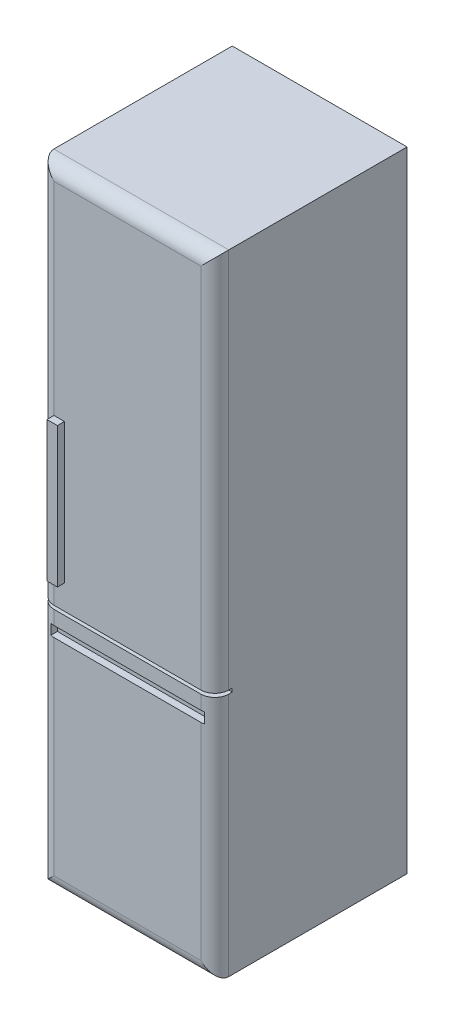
ISO-10303-21;
HEADER;
FILE_DESCRIPTION(('STEP AP214'),'2;1');
FILE_NAME('part.step','',(''),(''),'','','');
FILE_SCHEMA(('AUTOMOTIVE_DESIGN { 1 0 10303 214 1 1 1 1 }'));
ENDSEC;
DATA;
#1=APPLICATION_CONTEXT('core data for automotive mechanical design processes');
#2=APPLICATION_PROTOCOL_DEFINITION('international standard','automotive_design',2000,#1);
#3=PRODUCT_CONTEXT('',#1,'mechanical');
#4=PRODUCT('Part','Part','',(#3));
#5=PRODUCT_RELATED_PRODUCT_CATEGORY('part','',(#4));
#6=PRODUCT_DEFINITION_FORMATION('','',#4);
#7=PRODUCT_DEFINITION_CONTEXT('part definition',#1,'design');
#8=PRODUCT_DEFINITION('design','',#6,#7);
#9=PRODUCT_DEFINITION_SHAPE('','',#8);
#10=(LENGTH_UNIT() NAMED_UNIT(*) SI_UNIT(.MILLI.,.METRE.));
#11=(NAMED_UNIT(*) PLANE_ANGLE_UNIT() SI_UNIT($,.RADIAN.));
#12=(NAMED_UNIT(*) SI_UNIT($,.STERADIAN.) SOLID_ANGLE_UNIT());
#13=UNCERTAINTY_MEASURE_WITH_UNIT(LENGTH_MEASURE(1.E-05),#10,'distance_accuracy_value','');
#14=(GEOMETRIC_REPRESENTATION_CONTEXT(3) GLOBAL_UNCERTAINTY_ASSIGNED_CONTEXT((#13)) GLOBAL_UNIT_ASSIGNED_CONTEXT((#10,
#11,#12)) REPRESENTATION_CONTEXT('',''));
#15=CARTESIAN_POINT('',(0.,0.,0.));
#16=DIRECTION('',(0.,0.,1.));
#17=DIRECTION('',(1.,0.,0.));
#18=AXIS2_PLACEMENT_3D('',#15,#16,#17);
#19=CARTESIAN_POINT('',(0.,1800.,550.));
#20=DIRECTION('',(0.,0.,-1.));
#21=DIRECTION('',(-1.,0.,0.));
#22=AXIS2_PLACEMENT_3D('',#19,#20,#21);
#23=PLANE('',#22);
#24=DIRECTION('',(-1.,0.,0.));
#25=VECTOR('',#24,1.);
#26=CARTESIAN_POINT('',(30.0000000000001,660.,550.));
#27=LINE('',#26,#25);
#28=CARTESIAN_POINT('',(460.,660.,550.));
#29=VERTEX_POINT('',#28);
#30=CARTESIAN_POINT('',(40.0000000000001,660.,550.));
#31=VERTEX_POINT('',#30);
#32=EDGE_CURVE('E207',#29,#31,#27,.T.);
#33=ORIENTED_EDGE('',*,*,#32,.F.);
#34=DIRECTION('',(0.,-1.,0.));
#35=VECTOR('',#34,1.);
#36=CARTESIAN_POINT('',(460.,1800.,550.));
#37=LINE('',#36,#35);
#38=CARTESIAN_POINT('',(460.,700.,550.));
#39=VERTEX_POINT('',#38);
#40=EDGE_CURVE('E313',#29,#39,#37,.F.);
#41=ORIENTED_EDGE('',*,*,#40,.T.);
#42=DIRECTION('',(1.,0.,0.));
#43=VECTOR('',#42,1.);
#44=CARTESIAN_POINT('',(0.,700.,550.));
#45=LINE('',#44,#43);
#46=CARTESIAN_POINT('',(40.0000000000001,700.,550.));
#47=VERTEX_POINT('',#46);
#48=EDGE_CURVE('E256',#47,#39,#45,.T.);
#49=ORIENTED_EDGE('',*,*,#48,.F.);
#50=DIRECTION('',(0.,-1.,0.));
#51=VECTOR('',#50,1.);
#52=CARTESIAN_POINT('',(40.0000000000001,1800.,550.));
#53=LINE('',#52,#51);
#54=EDGE_CURVE('E311',#47,#31,#53,.T.);
#55=ORIENTED_EDGE('',*,*,#54,.T.);
#56=EDGE_LOOP('',(#33,#41,#49,#55));
#57=FACE_BOUND('',#56,.T.);
#58=ADVANCED_FACE('F33',(#57),#23,.F.);
#59=DIRECTION('',(-1.,0.,0.));
#60=VECTOR('',#59,1.);
#61=CARTESIAN_POINT('',(0.,710.,550.));
#62=LINE('',#61,#60);
#63=CARTESIAN_POINT('',(460.,710.,550.));
#64=VERTEX_POINT('',#63);
#65=CARTESIAN_POINT('',(40.0000000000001,710.,550.));
#66=VERTEX_POINT('',#65);
#67=EDGE_CURVE('E261',#64,#66,#62,.T.);
#68=ORIENTED_EDGE('',*,*,#67,.F.);
#69=DIRECTION('',(0.,-1.,0.));
#70=VECTOR('',#69,1.);
#71=CARTESIAN_POINT('',(460.,1800.,550.));
#72=LINE('',#71,#70);
#73=CARTESIAN_POINT('',(460.,1760.,550.));
#74=VERTEX_POINT('',#73);
#75=EDGE_CURVE('E42',#64,#74,#72,.F.);
#76=ORIENTED_EDGE('',*,*,#75,.T.);
#77=DIRECTION('',(1.,0.,0.));
#78=VECTOR('',#77,1.);
#79=CARTESIAN_POINT('',(0.,1760.,550.));
#80=LINE('',#79,#78);
#81=CARTESIAN_POINT('',(40.0000000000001,1760.,550.));
#82=VERTEX_POINT('',#81);
#83=EDGE_CURVE('E53',#74,#82,#80,.F.);
#84=ORIENTED_EDGE('',*,*,#83,.T.);
#85=DIRECTION('',(0.,-1.,0.));
#86=VECTOR('',#85,1.);
#87=CARTESIAN_POINT('',(40.0000000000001,1800.,550.));
#88=LINE('',#87,#86);
#89=CARTESIAN_POINT('',(40.0000000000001,1180.,550.));
#90=VERTEX_POINT('',#89);
#91=EDGE_CURVE('E347',#82,#90,#88,.T.);
#92=ORIENTED_EDGE('',*,*,#91,.T.);
#93=DIRECTION('',(-1.,0.,0.));
#94=VECTOR('',#93,1.);
#95=CARTESIAN_POINT('',(40.0000000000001,1180.,550.));
#96=LINE('',#95,#94);
#97=CARTESIAN_POINT('',(70.0000000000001,1180.,550.));
#98=VERTEX_POINT('',#97);
#99=EDGE_CURVE('E228',#98,#90,#96,.T.);
#100=ORIENTED_EDGE('',*,*,#99,.F.);
#101=DIRECTION('',(0.,1.,0.));
#102=VECTOR('',#101,1.);
#103=CARTESIAN_POINT('',(70.0000000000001,1180.,550.));
#104=LINE('',#103,#102);
#105=CARTESIAN_POINT('',(70.0000000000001,780.,550.));
#106=VERTEX_POINT('',#105);
#107=EDGE_CURVE('E240',#106,#98,#104,.T.);
#108=ORIENTED_EDGE('',*,*,#107,.F.);
#109=DIRECTION('',(1.,0.,0.));
#110=VECTOR('',#109,1.);
#111=CARTESIAN_POINT('',(40.0000000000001,780.,550.));
#112=LINE('',#111,#110);
#113=CARTESIAN_POINT('',(40.0000000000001,780.,550.));
#114=VERTEX_POINT('',#113);
#115=EDGE_CURVE('E237',#114,#106,#112,.T.);
#116=ORIENTED_EDGE('',*,*,#115,.F.);
#117=DIRECTION('',(0.,-1.,0.));
#118=VECTOR('',#117,1.);
#119=CARTESIAN_POINT('',(40.0000000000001,1800.,550.));
#120=LINE('',#119,#118);
#121=EDGE_CURVE('E345',#114,#66,#120,.T.);
#122=ORIENTED_EDGE('',*,*,#121,.T.);
#123=EDGE_LOOP('',(#68,#76,#84,#92,#100,#108,#116,#122));
#124=FACE_BOUND('',#123,.T.);
#125=ADVANCED_FACE('F369',(#124),#23,.F.);
#126=CARTESIAN_POINT('',(0.,1800.,0.));
#127=DIRECTION('',(1.,0.,0.));
#128=DIRECTION('',(0.,0.,-1.));
#129=AXIS2_PLACEMENT_3D('',#126,#127,#128);
#130=PLANE('',#129);
#131=DIRECTION('',(0.,0.,1.));
#132=VECTOR('',#131,1.);
#133=CARTESIAN_POINT('',(0.,0.,0.));
#134=LINE('',#133,#132);
#135=CARTESIAN_POINT('',(0.,0.,0.));
#136=VERTEX_POINT('',#135);
#137=CARTESIAN_POINT('',(0.,0.,510.));
#138=VERTEX_POINT('',#137);
#139=EDGE_CURVE('E276',#136,#138,#134,.T.);
#140=ORIENTED_EDGE('',*,*,#139,.T.);
#141=DIRECTION('',(0.,-1.,0.));
#142=VECTOR('',#141,1.);
#143=CARTESIAN_POINT('',(0.,1800.,510.));
#144=LINE('',#143,#142);
#145=CARTESIAN_POINT('',(0.,700.,510.));
#146=VERTEX_POINT('',#145);
#147=EDGE_CURVE('E339',#138,#146,#144,.F.);
#148=ORIENTED_EDGE('',*,*,#147,.T.);
#149=DIRECTION('',(0.,0.,1.));
#150=VECTOR('',#149,1.);
#151=CARTESIAN_POINT('',(0.,700.,500.));
#152=LINE('',#151,#150);
#153=CARTESIAN_POINT('',(0.,700.,500.));
#154=VERTEX_POINT('',#153);
#155=EDGE_CURVE('E268',#154,#146,#152,.T.);
#156=ORIENTED_EDGE('',*,*,#155,.F.);
#157=DIRECTION('',(0.,-1.,0.));
#158=VECTOR('',#157,1.);
#159=CARTESIAN_POINT('',(0.,710.,500.));
#160=LINE('',#159,#158);
#161=CARTESIAN_POINT('',(0.,710.,500.));
#162=VERTEX_POINT('',#161);
#163=EDGE_CURVE('E257',#162,#154,#160,.T.);
#164=ORIENTED_EDGE('',*,*,#163,.F.);
#165=DIRECTION('',(0.,0.,1.));
#166=VECTOR('',#165,1.);
#167=CARTESIAN_POINT('',(0.,710.,500.));
#168=LINE('',#167,#166);
#169=CARTESIAN_POINT('',(0.,710.,510.));
#170=VERTEX_POINT('',#169);
#171=EDGE_CURVE('E273',#162,#170,#168,.T.);
#172=ORIENTED_EDGE('',*,*,#171,.T.);
#173=DIRECTION('',(0.,-1.,0.));
#174=VECTOR('',#173,1.);
#175=CARTESIAN_POINT('',(0.,1800.,510.));
#176=LINE('',#175,#174);
#177=CARTESIAN_POINT('',(0.,1800.,510.));
#178=VERTEX_POINT('',#177);
#179=EDGE_CURVE('E337',#170,#178,#176,.F.);
#180=ORIENTED_EDGE('',*,*,#179,.T.);
#181=DIRECTION('',(0.,0.,1.));
#182=VECTOR('',#181,1.);
#183=CARTESIAN_POINT('',(0.,1800.,0.));
#184=LINE('',#183,#182);
#185=CARTESIAN_POINT('',(0.,1800.,0.));
#186=VERTEX_POINT('',#185);
#187=EDGE_CURVE('E285',#186,#178,#184,.T.);
#188=ORIENTED_EDGE('',*,*,#187,.F.);
#189=DIRECTION('',(0.,-1.,0.));
#190=VECTOR('',#189,1.);
#191=CARTESIAN_POINT('',(0.,1800.,0.));
#192=LINE('',#191,#190);
#193=EDGE_CURVE('E293',#186,#136,#192,.T.);
#194=ORIENTED_EDGE('',*,*,#193,.T.);
#195=EDGE_LOOP('',(#140,#148,#156,#164,#172,#180,#188,#194));
#196=FACE_BOUND('',#195,.T.);
#197=ADVANCED_FACE('F403',(#196),#130,.F.);
#198=DIRECTION('',(1.,0.,0.));
#199=VECTOR('',#198,1.);
#200=CARTESIAN_POINT('',(0.,40.,550.));
#201=LINE('',#200,#199);
#202=CARTESIAN_POINT('',(40.0000000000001,40.,550.));
#203=VERTEX_POINT('',#202);
#204=CARTESIAN_POINT('',(460.,40.,550.));
#205=VERTEX_POINT('',#204);
#206=EDGE_CURVE('E306',#203,#205,#201,.T.);
#207=ORIENTED_EDGE('',*,*,#206,.T.);
#208=DIRECTION('',(0.,-1.,0.));
#209=VECTOR('',#208,1.);
#210=CARTESIAN_POINT('',(460.,1800.,550.));
#211=LINE('',#210,#209);
#212=CARTESIAN_POINT('',(460.,630.,550.));
#213=VERTEX_POINT('',#212);
#214=EDGE_CURVE('E309',#205,#213,#211,.F.);
#215=ORIENTED_EDGE('',*,*,#214,.T.);
#216=DIRECTION('',(1.,0.,0.));
#217=VECTOR('',#216,1.);
#218=CARTESIAN_POINT('',(30.0000000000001,630.,550.));
#219=LINE('',#218,#217);
#220=CARTESIAN_POINT('',(40.0000000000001,630.,550.));
#221=VERTEX_POINT('',#220);
#222=EDGE_CURVE('E210',#221,#213,#219,.T.);
#223=ORIENTED_EDGE('',*,*,#222,.F.);
#224=DIRECTION('',(0.,-1.,0.));
#225=VECTOR('',#224,1.);
#226=CARTESIAN_POINT('',(40.0000000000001,1800.,550.));
#227=LINE('',#226,#225);
#228=EDGE_CURVE('E304',#221,#203,#227,.T.);
#229=ORIENTED_EDGE('',*,*,#228,.T.);
#230=EDGE_LOOP('',(#207,#215,#223,#229));
#231=FACE_BOUND('',#230,.T.);
#232=ADVANCED_FACE('F399',(#231),#23,.F.);
#233=CARTESIAN_POINT('',(500.,1800.,0.));
#234=DIRECTION('',(-1.,0.,0.));
#235=DIRECTION('',(0.,0.,1.));
#236=AXIS2_PLACEMENT_3D('',#233,#234,#235);
#237=PLANE('',#236);
#238=DIRECTION('',(0.,0.,1.));
#239=VECTOR('',#238,1.);
#240=CARTESIAN_POINT('',(500.,700.,500.));
#241=LINE('',#240,#239);
#242=CARTESIAN_POINT('',(500.,700.,500.));
#243=VERTEX_POINT('',#242);
#244=CARTESIAN_POINT('',(500.,700.,510.));
#245=VERTEX_POINT('',#244);
#246=EDGE_CURVE('E280',#243,#245,#241,.T.);
#247=ORIENTED_EDGE('',*,*,#246,.T.);
#248=DIRECTION('',(0.,-1.,0.));
#249=VECTOR('',#248,1.);
#250=CARTESIAN_POINT('',(500.,1800.,510.));
#251=LINE('',#250,#249);
#252=CARTESIAN_POINT('',(500.,0.,510.));
#253=VERTEX_POINT('',#252);
#254=EDGE_CURVE('E320',#245,#253,#251,.T.);
#255=ORIENTED_EDGE('',*,*,#254,.T.);
#256=DIRECTION('',(0.,0.,-1.));
#257=VECTOR('',#256,1.);
#258=CARTESIAN_POINT('',(500.,0.,0.));
#259=LINE('',#258,#257);
#260=CARTESIAN_POINT('',(500.,0.,0.));
#261=VERTEX_POINT('',#260);
#262=EDGE_CURVE('E296',#253,#261,#259,.T.);
#263=ORIENTED_EDGE('',*,*,#262,.T.);
#264=DIRECTION('',(0.,-1.,0.));
#265=VECTOR('',#264,1.);
#266=CARTESIAN_POINT('',(500.,1800.,0.));
#267=LINE('',#266,#265);
#268=CARTESIAN_POINT('',(500.,1800.,0.));
#269=VERTEX_POINT('',#268);
#270=EDGE_CURVE('E301',#269,#261,#267,.T.);
#271=ORIENTED_EDGE('',*,*,#270,.F.);
#272=DIRECTION('',(0.,0.,-1.));
#273=VECTOR('',#272,1.);
#274=CARTESIAN_POINT('',(500.,1800.,0.));
#275=LINE('',#274,#273);
#276=CARTESIAN_POINT('',(500.,1800.,510.));
#277=VERTEX_POINT('',#276);
#278=EDGE_CURVE('E288',#277,#269,#275,.T.);
#279=ORIENTED_EDGE('',*,*,#278,.F.);
#280=DIRECTION('',(0.,-1.,0.));
#281=VECTOR('',#280,1.);
#282=CARTESIAN_POINT('',(500.,1800.,510.));
#283=LINE('',#282,#281);
#284=CARTESIAN_POINT('',(500.,710.,510.));
#285=VERTEX_POINT('',#284);
#286=EDGE_CURVE('E317',#277,#285,#283,.T.);
#287=ORIENTED_EDGE('',*,*,#286,.T.);
#288=DIRECTION('',(0.,0.,1.));
#289=VECTOR('',#288,1.);
#290=CARTESIAN_POINT('',(500.,710.,500.));
#291=LINE('',#290,#289);
#292=CARTESIAN_POINT('',(500.,710.,500.));
#293=VERTEX_POINT('',#292);
#294=EDGE_CURVE('E277',#293,#285,#291,.T.);
#295=ORIENTED_EDGE('',*,*,#294,.F.);
#296=DIRECTION('',(0.,1.,0.));
#297=VECTOR('',#296,1.);
#298=CARTESIAN_POINT('',(500.,710.,500.));
#299=LINE('',#298,#297);
#300=EDGE_CURVE('E263',#243,#293,#299,.T.);
#301=ORIENTED_EDGE('',*,*,#300,.F.);
#302=EDGE_LOOP('',(#247,#255,#263,#271,#279,#287,#295,#301));
#303=FACE_BOUND('',#302,.T.);
#304=ADVANCED_FACE('F408',(#303),#237,.F.);
#305=CARTESIAN_POINT('',(0.,1800.,0.));
#306=DIRECTION('',(0.,0.,1.));
#307=DIRECTION('',(1.,0.,0.));
#308=AXIS2_PLACEMENT_3D('',#305,#306,#307);
#309=PLANE('',#308);
#310=DIRECTION('',(-1.,0.,0.));
#311=VECTOR('',#310,1.);
#312=CARTESIAN_POINT('',(0.,0.,0.));
#313=LINE('',#312,#311);
#314=EDGE_CURVE('E289',#261,#136,#313,.T.);
#315=ORIENTED_EDGE('',*,*,#314,.T.);
#316=ORIENTED_EDGE('',*,*,#193,.F.);
#317=DIRECTION('',(-1.,0.,0.));
#318=VECTOR('',#317,1.);
#319=CARTESIAN_POINT('',(0.,1800.,0.));
#320=LINE('',#319,#318);
#321=EDGE_CURVE('E291',#269,#186,#320,.T.);
#322=ORIENTED_EDGE('',*,*,#321,.F.);
#323=ORIENTED_EDGE('',*,*,#270,.T.);
#324=EDGE_LOOP('',(#315,#316,#322,#323));
#325=FACE_BOUND('',#324,.T.);
#326=ADVANCED_FACE('F414',(#325),#309,.F.);
#327=CARTESIAN_POINT('',(0.,1800.,0.));
#328=DIRECTION('',(0.,1.,0.));
#329=DIRECTION('',(0.,0.,1.));
#330=AXIS2_PLACEMENT_3D('',#327,#328,#329);
#331=PLANE('',#330);
#332=ORIENTED_EDGE('',*,*,#187,.T.);
#333=DIRECTION('',(1.,0.,0.));
#334=VECTOR('',#333,1.);
#335=CARTESIAN_POINT('',(500.,1800.,510.));
#336=LINE('',#335,#334);
#337=EDGE_CURVE('E11',#178,#277,#336,.T.);
#338=ORIENTED_EDGE('',*,*,#337,.T.);
#339=ORIENTED_EDGE('',*,*,#278,.T.);
#340=ORIENTED_EDGE('',*,*,#321,.T.);
#341=EDGE_LOOP('',(#332,#338,#339,#340));
#342=FACE_BOUND('',#341,.T.);
#343=ADVANCED_FACE('F461',(#342),#331,.T.);
#344=CARTESIAN_POINT('',(0.,0.,0.));
#345=DIRECTION('',(0.,1.,0.));
#346=DIRECTION('',(0.,0.,1.));
#347=AXIS2_PLACEMENT_3D('',#344,#345,#346);
#348=PLANE('',#347);
#349=ORIENTED_EDGE('',*,*,#262,.F.);
#350=DIRECTION('',(1.,0.,0.));
#351=VECTOR('',#350,1.);
#352=CARTESIAN_POINT('',(0.,0.,510.));
#353=LINE('',#352,#351);
#354=EDGE_CURVE('E315',#253,#138,#353,.F.);
#355=ORIENTED_EDGE('',*,*,#354,.T.);
#356=ORIENTED_EDGE('',*,*,#139,.F.);
#357=ORIENTED_EDGE('',*,*,#314,.F.);
#358=EDGE_LOOP('',(#349,#355,#356,#357));
#359=FACE_BOUND('',#358,.T.);
#360=ADVANCED_FACE('F467',(#359),#348,.F.);
#361=CARTESIAN_POINT('',(0.,710.,500.));
#362=DIRECTION('',(0.,1.,0.));
#363=DIRECTION('',(0.,0.,1.));
#364=AXIS2_PLACEMENT_3D('',#361,#362,#363);
#365=PLANE('',#364);
#366=ORIENTED_EDGE('',*,*,#294,.T.);
#367=CARTESIAN_POINT('',(460.,710.,510.));
#368=DIRECTION('',(0.,1.,0.));
#369=DIRECTION('',(0.,0.,1.));
#370=AXIS2_PLACEMENT_3D('',#367,#368,#369);
#371=CIRCLE('',#370,40.);
#372=EDGE_CURVE('E343',#285,#64,#371,.F.);
#373=ORIENTED_EDGE('',*,*,#372,.T.);
#374=ORIENTED_EDGE('',*,*,#67,.T.);
#375=CARTESIAN_POINT('',(40.0000000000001,710.,510.));
#376=DIRECTION('',(0.,1.,0.));
#377=DIRECTION('',(0.,0.,1.));
#378=AXIS2_PLACEMENT_3D('',#375,#376,#377);
#379=CIRCLE('',#378,40.);
#380=EDGE_CURVE('E341',#66,#170,#379,.F.);
#381=ORIENTED_EDGE('',*,*,#380,.T.);
#382=ORIENTED_EDGE('',*,*,#171,.F.);
#383=DIRECTION('',(-1.,0.,0.));
#384=VECTOR('',#383,1.);
#385=CARTESIAN_POINT('',(0.,710.,500.));
#386=LINE('',#385,#384);
#387=EDGE_CURVE('E265',#293,#162,#386,.T.);
#388=ORIENTED_EDGE('',*,*,#387,.F.);
#389=EDGE_LOOP('',(#366,#373,#374,#381,#382,#388));
#390=FACE_BOUND('',#389,.T.);
#391=ADVANCED_FACE('F454',(#390),#365,.F.);
#392=CARTESIAN_POINT('',(0.,700.,500.));
#393=DIRECTION('',(0.,-1.,0.));
#394=DIRECTION('',(0.,0.,-1.));
#395=AXIS2_PLACEMENT_3D('',#392,#393,#394);
#396=PLANE('',#395);
#397=ORIENTED_EDGE('',*,*,#48,.T.);
#398=CARTESIAN_POINT('',(460.,700.,510.));
#399=DIRECTION('',(0.,-1.,0.));
#400=DIRECTION('',(0.,0.,-1.));
#401=AXIS2_PLACEMENT_3D('',#398,#399,#400);
#402=CIRCLE('',#401,40.);
#403=EDGE_CURVE('E334',#39,#245,#402,.F.);
#404=ORIENTED_EDGE('',*,*,#403,.T.);
#405=ORIENTED_EDGE('',*,*,#246,.F.);
#406=DIRECTION('',(1.,0.,0.));
#407=VECTOR('',#406,1.);
#408=CARTESIAN_POINT('',(0.,700.,500.));
#409=LINE('',#408,#407);
#410=EDGE_CURVE('E260',#154,#243,#409,.T.);
#411=ORIENTED_EDGE('',*,*,#410,.F.);
#412=ORIENTED_EDGE('',*,*,#155,.T.);
#413=CARTESIAN_POINT('',(40.0000000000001,700.,510.));
#414=DIRECTION('',(0.,-1.,0.));
#415=DIRECTION('',(0.,0.,-1.));
#416=AXIS2_PLACEMENT_3D('',#413,#414,#415);
#417=CIRCLE('',#416,40.);
#418=EDGE_CURVE('E332',#146,#47,#417,.F.);
#419=ORIENTED_EDGE('',*,*,#418,.T.);
#420=EDGE_LOOP('',(#397,#404,#405,#411,#412,#419));
#421=FACE_BOUND('',#420,.T.);
#422=ADVANCED_FACE('F446',(#421),#396,.F.);
#423=CARTESIAN_POINT('',(0.,0.,500.));
#424=DIRECTION('',(0.,0.,1.));
#425=DIRECTION('',(1.,0.,0.));
#426=AXIS2_PLACEMENT_3D('',#423,#424,#425);
#427=PLANE('',#426);
#428=ORIENTED_EDGE('',*,*,#163,.T.);
#429=ORIENTED_EDGE('',*,*,#410,.T.);
#430=ORIENTED_EDGE('',*,*,#300,.T.);
#431=ORIENTED_EDGE('',*,*,#387,.T.);
#432=EDGE_LOOP('',(#428,#429,#430,#431));
#433=FACE_BOUND('',#432,.T.);
#434=ADVANCED_FACE('F394',(#433),#427,.T.);
#435=CARTESIAN_POINT('',(40.0000000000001,1180.,570.));
#436=DIRECTION('',(1.,0.,0.));
#437=DIRECTION('',(0.,1.,0.));
#438=AXIS2_PLACEMENT_3D('',#435,#436,#437);
#439=PLANE('',#438);
#440=DIRECTION('',(0.,-1.,0.));
#441=VECTOR('',#440,1.);
#442=CARTESIAN_POINT('',(40.0000000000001,1180.,550.));
#443=LINE('',#442,#441);
#444=EDGE_CURVE('E219',#90,#114,#443,.T.);
#445=ORIENTED_EDGE('',*,*,#444,.T.);
#446=DIRECTION('',(0.,0.,-1.));
#447=VECTOR('',#446,1.);
#448=CARTESIAN_POINT('',(40.0000000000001,780.,570.));
#449=LINE('',#448,#447);
#450=CARTESIAN_POINT('',(40.0000000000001,780.,570.));
#451=VERTEX_POINT('',#450);
#452=EDGE_CURVE('E253',#451,#114,#449,.T.);
#453=ORIENTED_EDGE('',*,*,#452,.F.);
#454=DIRECTION('',(0.,-1.,0.));
#455=VECTOR('',#454,1.);
#456=CARTESIAN_POINT('',(40.0000000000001,1180.,570.));
#457=LINE('',#456,#455);
#458=CARTESIAN_POINT('',(40.0000000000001,1180.,570.));
#459=VERTEX_POINT('',#458);
#460=EDGE_CURVE('E224',#459,#451,#457,.T.);
#461=ORIENTED_EDGE('',*,*,#460,.F.);
#462=DIRECTION('',(0.,0.,-1.));
#463=VECTOR('',#462,1.);
#464=CARTESIAN_POINT('',(40.0000000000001,1180.,570.));
#465=LINE('',#464,#463);
#466=EDGE_CURVE('E234',#459,#90,#465,.T.);
#467=ORIENTED_EDGE('',*,*,#466,.T.);
#468=EDGE_LOOP('',(#445,#453,#461,#467));
#469=FACE_BOUND('',#468,.T.);
#470=ADVANCED_FACE('F377',(#469),#439,.F.);
#471=CARTESIAN_POINT('',(40.0000000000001,780.,570.));
#472=DIRECTION('',(0.,1.,0.));
#473=DIRECTION('',(0.,0.,1.));
#474=AXIS2_PLACEMENT_3D('',#471,#472,#473);
#475=PLANE('',#474);
#476=ORIENTED_EDGE('',*,*,#115,.T.);
#477=DIRECTION('',(0.,0.,-1.));
#478=VECTOR('',#477,1.);
#479=CARTESIAN_POINT('',(70.0000000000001,780.,570.));
#480=LINE('',#479,#478);
#481=CARTESIAN_POINT('',(70.0000000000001,780.,570.));
#482=VERTEX_POINT('',#481);
#483=EDGE_CURVE('E250',#482,#106,#480,.T.);
#484=ORIENTED_EDGE('',*,*,#483,.F.);
#485=DIRECTION('',(1.,0.,0.));
#486=VECTOR('',#485,1.);
#487=CARTESIAN_POINT('',(40.0000000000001,780.,570.));
#488=LINE('',#487,#486);
#489=EDGE_CURVE('E227',#451,#482,#488,.T.);
#490=ORIENTED_EDGE('',*,*,#489,.F.);
#491=ORIENTED_EDGE('',*,*,#452,.T.);
#492=EDGE_LOOP('',(#476,#484,#490,#491));
#493=FACE_BOUND('',#492,.T.);
#494=ADVANCED_FACE('F386',(#493),#475,.F.);
#495=CARTESIAN_POINT('',(70.0000000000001,1180.,570.));
#496=DIRECTION('',(-1.,0.,0.));
#497=DIRECTION('',(0.,-1.,0.));
#498=AXIS2_PLACEMENT_3D('',#495,#496,#497);
#499=PLANE('',#498);
#500=ORIENTED_EDGE('',*,*,#107,.T.);
#501=DIRECTION('',(0.,0.,-1.));
#502=VECTOR('',#501,1.);
#503=CARTESIAN_POINT('',(70.0000000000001,1180.,570.));
#504=LINE('',#503,#502);
#505=CARTESIAN_POINT('',(70.0000000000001,1180.,570.));
#506=VERTEX_POINT('',#505);
#507=EDGE_CURVE('E247',#506,#98,#504,.T.);
#508=ORIENTED_EDGE('',*,*,#507,.F.);
#509=DIRECTION('',(0.,1.,0.));
#510=VECTOR('',#509,1.);
#511=CARTESIAN_POINT('',(70.0000000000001,1180.,570.));
#512=LINE('',#511,#510);
#513=EDGE_CURVE('E230',#482,#506,#512,.T.);
#514=ORIENTED_EDGE('',*,*,#513,.F.);
#515=ORIENTED_EDGE('',*,*,#483,.T.);
#516=EDGE_LOOP('',(#500,#508,#514,#515));
#517=FACE_BOUND('',#516,.T.);
#518=ADVANCED_FACE('F384',(#517),#499,.F.);
#519=CARTESIAN_POINT('',(40.0000000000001,1180.,570.));
#520=DIRECTION('',(0.,-1.,0.));
#521=DIRECTION('',(0.,0.,-1.));
#522=AXIS2_PLACEMENT_3D('',#519,#520,#521);
#523=PLANE('',#522);
#524=ORIENTED_EDGE('',*,*,#99,.T.);
#525=ORIENTED_EDGE('',*,*,#466,.F.);
#526=DIRECTION('',(-1.,0.,0.));
#527=VECTOR('',#526,1.);
#528=CARTESIAN_POINT('',(40.0000000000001,1180.,570.));
#529=LINE('',#528,#527);
#530=EDGE_CURVE('E232',#506,#459,#529,.T.);
#531=ORIENTED_EDGE('',*,*,#530,.F.);
#532=ORIENTED_EDGE('',*,*,#507,.T.);
#533=EDGE_LOOP('',(#524,#525,#531,#532));
#534=FACE_BOUND('',#533,.T.);
#535=ADVANCED_FACE('F372',(#534),#523,.F.);
#536=CARTESIAN_POINT('',(0.,0.,570.));
#537=DIRECTION('',(0.,0.,1.));
#538=DIRECTION('',(1.,0.,0.));
#539=AXIS2_PLACEMENT_3D('',#536,#537,#538);
#540=PLANE('',#539);
#541=ORIENTED_EDGE('',*,*,#460,.T.);
#542=ORIENTED_EDGE('',*,*,#489,.T.);
#543=ORIENTED_EDGE('',*,*,#513,.T.);
#544=ORIENTED_EDGE('',*,*,#530,.T.);
#545=EDGE_LOOP('',(#541,#542,#543,#544));
#546=FACE_BOUND('',#545,.T.);
#547=ADVANCED_FACE('F380',(#546),#540,.T.);
#548=CARTESIAN_POINT('',(30.0000000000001,660.,530.));
#549=DIRECTION('',(-1.,0.,0.));
#550=DIRECTION('',(0.,-1.,0.));
#551=AXIS2_PLACEMENT_3D('',#548,#549,#550);
#552=PLANE('',#551);
#553=DIRECTION('',(0.,0.,1.));
#554=VECTOR('',#553,1.);
#555=CARTESIAN_POINT('',(30.0000000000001,660.,530.));
#556=LINE('',#555,#554);
#557=CARTESIAN_POINT('',(30.0000000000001,660.,530.));
#558=VERTEX_POINT('',#557);
#559=CARTESIAN_POINT('',(30.0000000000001,660.,548.729833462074));
#560=VERTEX_POINT('',#559);
#561=EDGE_CURVE('E217',#558,#560,#556,.T.);
#562=ORIENTED_EDGE('',*,*,#561,.T.);
#563=DIRECTION('',(0.,-1.,0.));
#564=VECTOR('',#563,1.);
#565=CARTESIAN_POINT('',(30.0000000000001,660.,548.729833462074));
#566=LINE('',#565,#564);
#567=CARTESIAN_POINT('',(30.0000000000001,630.,548.729833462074));
#568=VERTEX_POINT('',#567);
#569=EDGE_CURVE('E189',#560,#568,#566,.T.);
#570=ORIENTED_EDGE('',*,*,#569,.T.);
#571=DIRECTION('',(0.,0.,1.));
#572=VECTOR('',#571,1.);
#573=CARTESIAN_POINT('',(30.0000000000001,630.,530.));
#574=LINE('',#573,#572);
#575=CARTESIAN_POINT('',(30.0000000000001,630.,530.));
#576=VERTEX_POINT('',#575);
#577=EDGE_CURVE('E181',#576,#568,#574,.T.);
#578=ORIENTED_EDGE('',*,*,#577,.F.);
#579=DIRECTION('',(0.,-1.,0.));
#580=VECTOR('',#579,1.);
#581=CARTESIAN_POINT('',(30.0000000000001,660.,530.));
#582=LINE('',#581,#580);
#583=EDGE_CURVE('E186',#558,#576,#582,.T.);
#584=ORIENTED_EDGE('',*,*,#583,.F.);
#585=EDGE_LOOP('',(#562,#570,#578,#584));
#586=FACE_BOUND('',#585,.T.);
#587=ADVANCED_FACE('F184',(#586),#552,.F.);
#588=CARTESIAN_POINT('',(30.0000000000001,660.,530.));
#589=DIRECTION('',(0.,1.,0.));
#590=DIRECTION('',(0.,0.,1.));
#591=AXIS2_PLACEMENT_3D('',#588,#589,#590);
#592=PLANE('',#591);
#593=DIRECTION('',(0.,0.,1.));
#594=VECTOR('',#593,1.);
#595=CARTESIAN_POINT('',(470.,660.,530.));
#596=LINE('',#595,#594);
#597=CARTESIAN_POINT('',(470.,660.,530.));
#598=VERTEX_POINT('',#597);
#599=CARTESIAN_POINT('',(470.,660.,548.729833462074));
#600=VERTEX_POINT('',#599);
#601=EDGE_CURVE('E220',#598,#600,#596,.T.);
#602=ORIENTED_EDGE('',*,*,#601,.T.);
#603=CARTESIAN_POINT('',(460.,660.,510.));
#604=DIRECTION('',(0.,1.,0.));
#605=DIRECTION('',(0.,0.,1.));
#606=AXIS2_PLACEMENT_3D('',#603,#604,#605);
#607=CIRCLE('',#606,40.);
#608=EDGE_CURVE('E330',#600,#29,#607,.F.);
#609=ORIENTED_EDGE('',*,*,#608,.T.);
#610=ORIENTED_EDGE('',*,*,#32,.T.);
#611=CARTESIAN_POINT('',(40.0000000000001,660.,510.));
#612=DIRECTION('',(0.,1.,0.));
#613=DIRECTION('',(0.,0.,1.));
#614=AXIS2_PLACEMENT_3D('',#611,#612,#613);
#615=CIRCLE('',#614,40.);
#616=EDGE_CURVE('E328',#31,#560,#615,.F.);
#617=ORIENTED_EDGE('',*,*,#616,.T.);
#618=ORIENTED_EDGE('',*,*,#561,.F.);
#619=DIRECTION('',(-1.,0.,0.));
#620=VECTOR('',#619,1.);
#621=CARTESIAN_POINT('',(30.0000000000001,660.,530.));
#622=LINE('',#621,#620);
#623=EDGE_CURVE('E193',#598,#558,#622,.T.);
#624=ORIENTED_EDGE('',*,*,#623,.F.);
#625=EDGE_LOOP('',(#602,#609,#610,#617,#618,#624));
#626=FACE_BOUND('',#625,.T.);
#627=ADVANCED_FACE('F435',(#626),#592,.F.);
#628=CARTESIAN_POINT('',(470.,660.,530.));
#629=DIRECTION('',(1.,0.,0.));
#630=DIRECTION('',(0.,0.,-1.));
#631=AXIS2_PLACEMENT_3D('',#628,#629,#630);
#632=PLANE('',#631);
#633=DIRECTION('',(0.,0.,1.));
#634=VECTOR('',#633,1.);
#635=CARTESIAN_POINT('',(470.,630.,530.));
#636=LINE('',#635,#634);
#637=CARTESIAN_POINT('',(470.,630.,530.));
#638=VERTEX_POINT('',#637);
#639=CARTESIAN_POINT('',(470.,630.,548.729833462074));
#640=VERTEX_POINT('',#639);
#641=EDGE_CURVE('E192',#638,#640,#636,.T.);
#642=ORIENTED_EDGE('',*,*,#641,.T.);
#643=DIRECTION('',(0.,-1.,0.));
#644=VECTOR('',#643,1.);
#645=CARTESIAN_POINT('',(470.,630.,548.729833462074));
#646=LINE('',#645,#644);
#647=EDGE_CURVE('E326',#640,#600,#646,.F.);
#648=ORIENTED_EDGE('',*,*,#647,.T.);
#649=ORIENTED_EDGE('',*,*,#601,.F.);
#650=DIRECTION('',(0.,1.,0.));
#651=VECTOR('',#650,1.);
#652=CARTESIAN_POINT('',(470.,660.,530.));
#653=LINE('',#652,#651);
#654=EDGE_CURVE('E203',#638,#598,#653,.T.);
#655=ORIENTED_EDGE('',*,*,#654,.F.);
#656=EDGE_LOOP('',(#642,#648,#649,#655));
#657=FACE_BOUND('',#656,.T.);
#658=ADVANCED_FACE('F433',(#657),#632,.F.);
#659=CARTESIAN_POINT('',(30.0000000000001,630.,530.));
#660=DIRECTION('',(0.,-1.,0.));
#661=DIRECTION('',(0.,0.,-1.));
#662=AXIS2_PLACEMENT_3D('',#659,#660,#661);
#663=PLANE('',#662);
#664=ORIENTED_EDGE('',*,*,#222,.T.);
#665=CARTESIAN_POINT('',(460.,630.,510.));
#666=DIRECTION('',(0.,-1.,0.));
#667=DIRECTION('',(0.,0.,-1.));
#668=AXIS2_PLACEMENT_3D('',#665,#666,#667);
#669=CIRCLE('',#668,40.);
#670=EDGE_CURVE('E324',#213,#640,#669,.F.);
#671=ORIENTED_EDGE('',*,*,#670,.T.);
#672=ORIENTED_EDGE('',*,*,#641,.F.);
#673=DIRECTION('',(1.,0.,0.));
#674=VECTOR('',#673,1.);
#675=CARTESIAN_POINT('',(30.0000000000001,630.,530.));
#676=LINE('',#675,#674);
#677=EDGE_CURVE('E196',#576,#638,#676,.T.);
#678=ORIENTED_EDGE('',*,*,#677,.F.);
#679=ORIENTED_EDGE('',*,*,#577,.T.);
#680=CARTESIAN_POINT('',(40.0000000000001,630.,510.));
#681=DIRECTION('',(0.,-1.,0.));
#682=DIRECTION('',(0.,0.,-1.));
#683=AXIS2_PLACEMENT_3D('',#680,#681,#682);
#684=CIRCLE('',#683,40.);
#685=EDGE_CURVE('E322',#568,#221,#684,.F.);
#686=ORIENTED_EDGE('',*,*,#685,.T.);
#687=EDGE_LOOP('',(#664,#671,#672,#678,#679,#686));
#688=FACE_BOUND('',#687,.T.);
#689=ADVANCED_FACE('F198',(#688),#663,.F.);
#690=CARTESIAN_POINT('',(0.,0.,530.));
#691=DIRECTION('',(0.,0.,1.));
#692=DIRECTION('',(1.,0.,0.));
#693=AXIS2_PLACEMENT_3D('',#690,#691,#692);
#694=PLANE('',#693);
#695=ORIENTED_EDGE('',*,*,#583,.T.);
#696=ORIENTED_EDGE('',*,*,#677,.T.);
#697=ORIENTED_EDGE('',*,*,#654,.T.);
#698=ORIENTED_EDGE('',*,*,#623,.T.);
#699=EDGE_LOOP('',(#695,#696,#697,#698));
#700=FACE_BOUND('',#699,.T.);
#701=ADVANCED_FACE('F205',(#700),#694,.T.);
#702=CARTESIAN_POINT('',(40.0000000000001,1800.,510.));
#703=DIRECTION('',(0.,-1.,0.));
#704=DIRECTION('',(0.,0.,-1.));
#705=AXIS2_PLACEMENT_3D('',#702,#703,#704);
#706=CYLINDRICAL_SURFACE('',#705,40.);
#707=ORIENTED_EDGE('',*,*,#418,.F.);
#708=ORIENTED_EDGE('',*,*,#147,.F.);
#709=CARTESIAN_POINT('',(40.0000000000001,40.,510.));
#710=DIRECTION('',(0.707106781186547,-0.707106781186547,0.));
#711=DIRECTION('',(-0.707106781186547,-0.707106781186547,0.));
#712=AXIS2_PLACEMENT_3D('',#709,#710,#711);
#713=ELLIPSE('',#712,56.5685424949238,40.);
#714=EDGE_CURVE('E215',#203,#138,#713,.T.);
#715=ORIENTED_EDGE('',*,*,#714,.F.);
#716=ORIENTED_EDGE('',*,*,#228,.F.);
#717=ORIENTED_EDGE('',*,*,#685,.F.);
#718=ORIENTED_EDGE('',*,*,#569,.F.);
#719=ORIENTED_EDGE('',*,*,#616,.F.);
#720=ORIENTED_EDGE('',*,*,#54,.F.);
#721=EDGE_LOOP('',(#707,#708,#715,#716,#717,#718,#719,#720));
#722=FACE_BOUND('',#721,.T.);
#723=ADVANCED_FACE('F439',(#722),#706,.T.);
#724=CARTESIAN_POINT('',(460.,1800.,510.));
#725=DIRECTION('',(0.,-1.,0.));
#726=DIRECTION('',(0.,0.,-1.));
#727=AXIS2_PLACEMENT_3D('',#724,#725,#726);
#728=CYLINDRICAL_SURFACE('',#727,40.);
#729=ORIENTED_EDGE('',*,*,#670,.F.);
#730=ORIENTED_EDGE('',*,*,#214,.F.);
#731=CARTESIAN_POINT('',(460.,40.,510.));
#732=DIRECTION('',(-0.707106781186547,-0.707106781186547,0.));
#733=DIRECTION('',(0.707106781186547,-0.707106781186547,0.));
#734=AXIS2_PLACEMENT_3D('',#731,#732,#733);
#735=ELLIPSE('',#734,56.5685424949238,40.);
#736=EDGE_CURVE('E351',#253,#205,#735,.T.);
#737=ORIENTED_EDGE('',*,*,#736,.F.);
#738=ORIENTED_EDGE('',*,*,#254,.F.);
#739=ORIENTED_EDGE('',*,*,#403,.F.);
#740=ORIENTED_EDGE('',*,*,#40,.F.);
#741=ORIENTED_EDGE('',*,*,#608,.F.);
#742=ORIENTED_EDGE('',*,*,#647,.F.);
#743=EDGE_LOOP('',(#729,#730,#737,#738,#739,#740,#741,#742));
#744=FACE_BOUND('',#743,.T.);
#745=ADVANCED_FACE('F429',(#744),#728,.T.);
#746=CARTESIAN_POINT('',(0.,40.,510.));
#747=DIRECTION('',(1.,0.,0.));
#748=DIRECTION('',(0.,0.,-1.));
#749=AXIS2_PLACEMENT_3D('',#746,#747,#748);
#750=CYLINDRICAL_SURFACE('',#749,40.);
#751=ORIENTED_EDGE('',*,*,#714,.T.);
#752=ORIENTED_EDGE('',*,*,#354,.F.);
#753=ORIENTED_EDGE('',*,*,#736,.T.);
#754=ORIENTED_EDGE('',*,*,#206,.F.);
#755=EDGE_LOOP('',(#751,#752,#753,#754));
#756=FACE_BOUND('',#755,.T.);
#757=ADVANCED_FACE('F423',(#756),#750,.T.);
#758=CARTESIAN_POINT('',(40.0000000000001,1800.,510.));
#759=DIRECTION('',(0.,-1.,0.));
#760=DIRECTION('',(0.,0.,-1.));
#761=AXIS2_PLACEMENT_3D('',#758,#759,#760);
#762=CYLINDRICAL_SURFACE('',#761,40.);
#763=ORIENTED_EDGE('',*,*,#444,.F.);
#764=ORIENTED_EDGE('',*,*,#91,.F.);
#765=CARTESIAN_POINT('',(40.0000000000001,1760.,510.));
#766=DIRECTION('',(-0.707106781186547,-0.707106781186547,0.));
#767=DIRECTION('',(0.707106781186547,-0.707106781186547,0.));
#768=AXIS2_PLACEMENT_3D('',#765,#766,#767);
#769=ELLIPSE('',#768,56.5685424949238,40.);
#770=EDGE_CURVE('E37',#178,#82,#769,.F.);
#771=ORIENTED_EDGE('',*,*,#770,.F.);
#772=ORIENTED_EDGE('',*,*,#179,.F.);
#773=ORIENTED_EDGE('',*,*,#380,.F.);
#774=ORIENTED_EDGE('',*,*,#121,.F.);
#775=EDGE_LOOP('',(#763,#764,#771,#772,#773,#774));
#776=FACE_BOUND('',#775,.T.);
#777=ADVANCED_FACE('F35',(#776),#762,.T.);
#778=CARTESIAN_POINT('',(0.,1760.,510.));
#779=DIRECTION('',(-1.,0.,0.));
#780=DIRECTION('',(0.,0.,1.));
#781=AXIS2_PLACEMENT_3D('',#778,#779,#780);
#782=CYLINDRICAL_SURFACE('',#781,40.);
#783=ORIENTED_EDGE('',*,*,#770,.T.);
#784=ORIENTED_EDGE('',*,*,#83,.F.);
#785=CARTESIAN_POINT('',(460.,1760.,510.));
#786=DIRECTION('',(-0.707106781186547,0.707106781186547,0.));
#787=DIRECTION('',(-0.707106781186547,-0.707106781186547,0.));
#788=AXIS2_PLACEMENT_3D('',#785,#786,#787);
#789=ELLIPSE('',#788,56.5685424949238,40.);
#790=EDGE_CURVE('E354',#277,#74,#789,.F.);
#791=ORIENTED_EDGE('',*,*,#790,.F.);
#792=ORIENTED_EDGE('',*,*,#337,.F.);
#793=EDGE_LOOP('',(#783,#784,#791,#792));
#794=FACE_BOUND('',#793,.T.);
#795=ADVANCED_FACE('F363',(#794),#782,.T.);
#796=CARTESIAN_POINT('',(460.,1800.,510.));
#797=DIRECTION('',(0.,-1.,0.));
#798=DIRECTION('',(0.,0.,-1.));
#799=AXIS2_PLACEMENT_3D('',#796,#797,#798);
#800=CYLINDRICAL_SURFACE('',#799,40.);
#801=ORIENTED_EDGE('',*,*,#790,.T.);
#802=ORIENTED_EDGE('',*,*,#75,.F.);
#803=ORIENTED_EDGE('',*,*,#372,.F.);
#804=ORIENTED_EDGE('',*,*,#286,.F.);
#805=EDGE_LOOP('',(#801,#802,#803,#804));
#806=FACE_BOUND('',#805,.T.);
#807=ADVANCED_FACE('F456',(#806),#800,.T.);
#808=CLOSED_SHELL('',(#58,#125,#197,#232,#304,#326,#343,#360,#391,#422,#434,#470,#494,#518,#535,
#547,#587,#627,#658,#689,#701,#723,#745,#757,#777,#795,#807));
#809=MANIFOLD_SOLID_BREP('B2',#808);
#810=ADVANCED_BREP_SHAPE_REPRESENTATION('',(#18,#809),#14);
#811=SHAPE_DEFINITION_REPRESENTATION(#9,#810);
ENDSEC;
END-ISO-10303-21;
